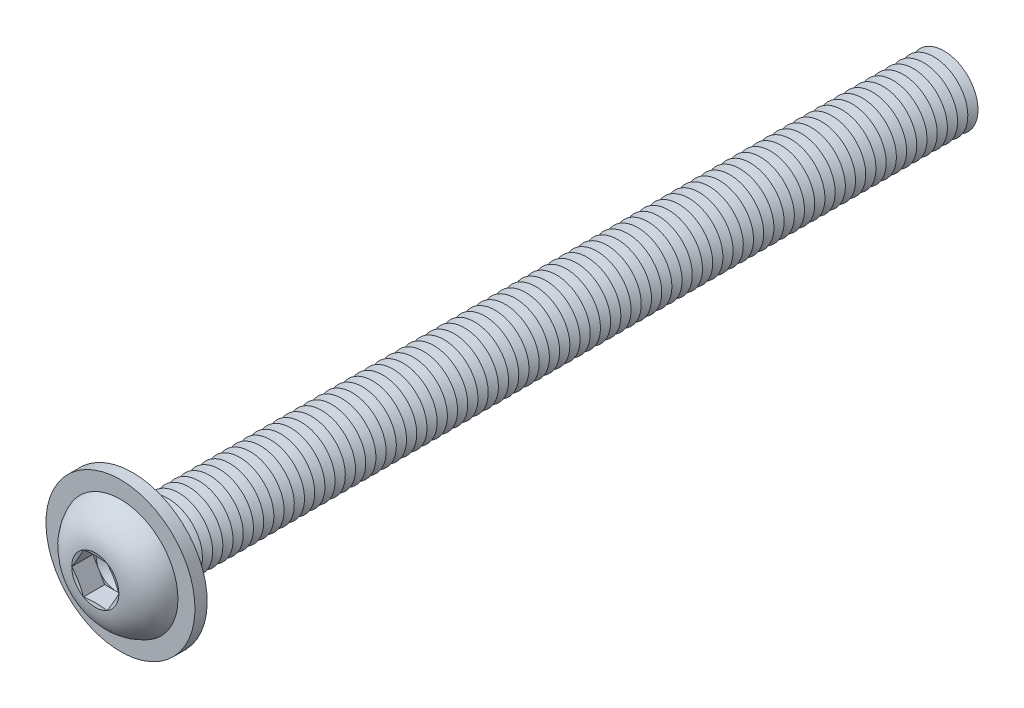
from build123d import *

# Parameters (mm, degrees)
FILLET1_R           = 0.75
LPATTERN1_COUNT     = 80
LPATTERN1_PITCH     = 1.5
CUT_EXTRUDE1_DEPTH  = 3.12
SKETCH5_R           = 10.95
SKETCH5_R_2         = 5.75
BOSS_EXTRUDE1_DEPTH = 1.8


with BuildPart() as part:
    # Sketch1 → Revolve1 (revolve)
    with BuildSketch(Plane(origin=(0, 0, 0), x_dir=(0, 0, -1), z_dir=(1, 0, 0))):
        with BuildLine():
            Line((0, 5), (0, 8.75))
            ThreePointArc((0, 8.75), (-3.814142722, 7.21429474), (-5.5, 3.4641))
            Line((-5.5, 3.4641), (-5.035898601, 1.73205))
            Line((-5.035898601, 1.73205), (-5.5, 1.73205))
            Line((-5.5, 1.73205), (-5.5, 0))
            Line((-5.5, 0), (120, 0))
            Line((120, 0), (120, 5))
            Line((120, 5), (0, 5))
        make_face()
    revolve(axis=Axis((0, 0, -120), (0, 0, 1)))

    # Fillet1
    fillet1_edges = [part.edges().sort_by_distance(p)[0] for p in [
        (0, -5, 0),
    ]]
    fillet(fillet1_edges, radius=FILLET1_R)

    # Sketch2 → Cut-Revolve1 (revolve, cut)
    with BuildSketch(Plane(origin=(0, 0, 0), x_dir=(0, 0, -1), z_dir=(1, 0, 0))):
        Polygon((119.25, 5), (120.75, 5), (120, 3.700961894), align=None)
    cut_revolve1 = revolve(axis=Axis((0, 0, -120), (0, 0, -1)), mode=Mode.SUBTRACT)

    # LPattern1: Cut-Revolve1 ×80
    with Locations(*[(0, 0, i * LPATTERN1_PITCH) for i in range(1, LPATTERN1_COUNT)]):
        add(cut_revolve1, mode=Mode.SUBTRACT)

    # Sketch3 → Cut-Extrude1 (cut)
    with BuildSketch(Plane.XY.offset(5.5)):
        Polygon((1.73205, 2.999998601), (-1.73205, 2.999998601), (-3.4641, 0), (-1.73205, -2.999998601), (1.73205, -2.999998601), (3.4641, 0), align=None)
    extrude(amount=-CUT_EXTRUDE1_DEPTH, mode=Mode.SUBTRACT)

    # Cut-Extrude2 cone 1 section (on through the dimple's axis) → Cut-Extrude2 (revolve, cut)
    with BuildSketch(Plane(origin=(0, 0, 2.38), x_dir=(0, -1, 0), z_dir=(1, 0, 0))):
        Polygon((0, 0), (2.999998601, 0), (0, 1.73205), align=None)
    revolve(axis=Axis((0, 0, 2.38), (0, 0, -1)), mode=Mode.SUBTRACT)

    # Sketch5 → Boss-Extrude1 (add)
    with BuildSketch(Plane(origin=(0, 0, 0), x_dir=(-1, 0, 0), z_dir=(0, 0, -1))):
        with Locations(Location((0, 0, 0), (0, 0, 90))):
            Circle(SKETCH5_R)
        Circle(SKETCH5_R_2, mode=Mode.SUBTRACT)
    extrude(amount=-BOSS_EXTRUDE1_DEPTH)


solid = part.part
